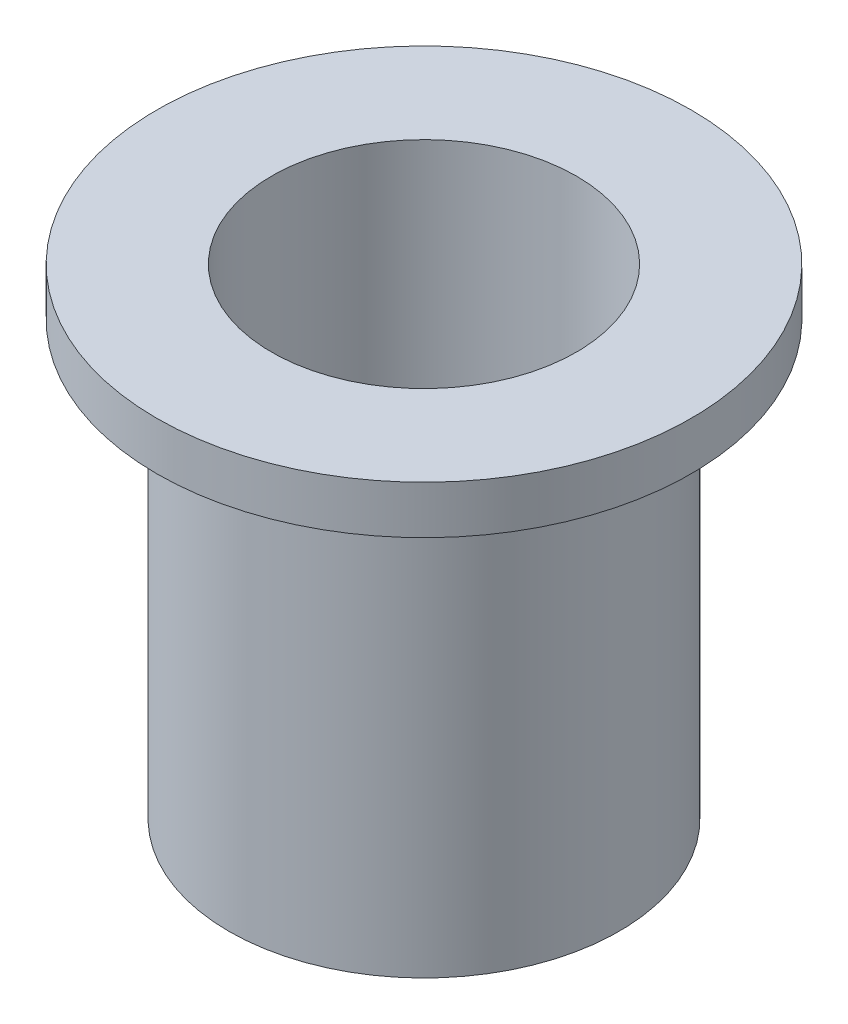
ISO-10303-21;
HEADER;
FILE_DESCRIPTION(('STEP AP214'),'2;1');
FILE_NAME('part.step','',(''),(''),'','','');
FILE_SCHEMA(('AUTOMOTIVE_DESIGN { 1 0 10303 214 1 1 1 1 }'));
ENDSEC;
DATA;
#1=APPLICATION_CONTEXT('core data for automotive mechanical design processes');
#2=APPLICATION_PROTOCOL_DEFINITION('international standard','automotive_design',2000,#1);
#3=PRODUCT_CONTEXT('',#1,'mechanical');
#4=PRODUCT('Part','Part','',(#3));
#5=PRODUCT_RELATED_PRODUCT_CATEGORY('part','',(#4));
#6=PRODUCT_DEFINITION_FORMATION('','',#4);
#7=PRODUCT_DEFINITION_CONTEXT('part definition',#1,'design');
#8=PRODUCT_DEFINITION('design','',#6,#7);
#9=PRODUCT_DEFINITION_SHAPE('','',#8);
#10=(LENGTH_UNIT() NAMED_UNIT(*) SI_UNIT(.MILLI.,.METRE.));
#11=(NAMED_UNIT(*) PLANE_ANGLE_UNIT() SI_UNIT($,.RADIAN.));
#12=(NAMED_UNIT(*) SI_UNIT($,.STERADIAN.) SOLID_ANGLE_UNIT());
#13=UNCERTAINTY_MEASURE_WITH_UNIT(LENGTH_MEASURE(1.E-05),#10,'distance_accuracy_value','');
#14=(GEOMETRIC_REPRESENTATION_CONTEXT(3) GLOBAL_UNCERTAINTY_ASSIGNED_CONTEXT((#13)) GLOBAL_UNIT_ASSIGNED_CONTEXT((#10,
#11,#12)) REPRESENTATION_CONTEXT('',''));
#15=CARTESIAN_POINT('',(0.,0.,0.));
#16=DIRECTION('',(0.,0.,1.));
#17=DIRECTION('',(1.,0.,0.));
#18=AXIS2_PLACEMENT_3D('',#15,#16,#17);
#19=CARTESIAN_POINT('',(0.,0.999999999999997,-5.5625));
#20=DIRECTION('',(0.,1.,0.));
#21=DIRECTION('',(0.,0.,1.));
#22=AXIS2_PLACEMENT_3D('',#19,#20,#21);
#23=PLANE('',#22);
#24=CARTESIAN_POINT('',(0.,0.999999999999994,0.));
#25=DIRECTION('',(0.,-1.,0.));
#26=DIRECTION('',(0.,0.,-1.));
#27=AXIS2_PLACEMENT_3D('',#24,#25,#26);
#28=CIRCLE('',#27,3.175);
#29=CARTESIAN_POINT('',(0.,0.999999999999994,-3.175));
#30=VERTEX_POINT('',#29);
#31=EDGE_CURVE('E10',#30,#30,#28,.T.);
#32=ORIENTED_EDGE('',*,*,#31,.T.);
#33=EDGE_LOOP('',(#32));
#34=FACE_BOUND('',#33,.T.);
#35=CARTESIAN_POINT('',(0.,1.,0.));
#36=DIRECTION('',(0.,-1.,0.));
#37=DIRECTION('',(0.,0.,-1.));
#38=AXIS2_PLACEMENT_3D('',#35,#36,#37);
#39=CIRCLE('',#38,5.5625);
#40=CARTESIAN_POINT('',(0.,1.,-5.5625));
#41=VERTEX_POINT('',#40);
#42=EDGE_CURVE('E52',#41,#41,#39,.T.);
#43=ORIENTED_EDGE('',*,*,#42,.F.);
#44=EDGE_LOOP('',(#43));
#45=FACE_BOUND('',#44,.T.);
#46=ADVANCED_FACE('F30',(#34,#45),#23,.T.);
#47=CARTESIAN_POINT('',(0.,0.,0.));
#48=DIRECTION('',(0.,-1.,0.));
#49=DIRECTION('',(0.,0.,-1.));
#50=AXIS2_PLACEMENT_3D('',#47,#48,#49);
#51=CYLINDRICAL_SURFACE('',#50,3.175);
#52=CARTESIAN_POINT('',(0.,-9.00000000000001,0.));
#53=DIRECTION('',(0.,-1.,0.));
#54=DIRECTION('',(0.,0.,-1.));
#55=AXIS2_PLACEMENT_3D('',#52,#53,#54);
#56=CIRCLE('',#55,3.175);
#57=CARTESIAN_POINT('',(0.,-9.00000000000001,-3.175));
#58=VERTEX_POINT('',#57);
#59=EDGE_CURVE('E36',#58,#58,#56,.T.);
#60=ORIENTED_EDGE('',*,*,#59,.T.);
#61=EDGE_LOOP('',(#60));
#62=FACE_BOUND('',#61,.T.);
#63=ORIENTED_EDGE('',*,*,#31,.F.);
#64=EDGE_LOOP('',(#63));
#65=FACE_BOUND('',#64,.T.);
#66=ADVANCED_FACE('F60',(#62,#65),#51,.F.);
#67=CARTESIAN_POINT('',(0.,-9.,-3.175));
#68=DIRECTION('',(0.,-1.,0.));
#69=DIRECTION('',(0.,0.,-1.));
#70=AXIS2_PLACEMENT_3D('',#67,#68,#69);
#71=PLANE('',#70);
#72=CARTESIAN_POINT('',(0.,-9.,0.));
#73=DIRECTION('',(0.,-1.,0.));
#74=DIRECTION('',(0.,0.,-1.));
#75=AXIS2_PLACEMENT_3D('',#72,#73,#74);
#76=CIRCLE('',#75,4.0625);
#77=CARTESIAN_POINT('',(0.,-9.,-4.0625));
#78=VERTEX_POINT('',#77);
#79=EDGE_CURVE('E40',#78,#78,#76,.T.);
#80=ORIENTED_EDGE('',*,*,#79,.T.);
#81=EDGE_LOOP('',(#80));
#82=FACE_BOUND('',#81,.T.);
#83=ORIENTED_EDGE('',*,*,#59,.F.);
#84=EDGE_LOOP('',(#83));
#85=FACE_BOUND('',#84,.T.);
#86=ADVANCED_FACE('F64',(#82,#85),#71,.T.);
#87=CARTESIAN_POINT('',(0.,0.,0.));
#88=DIRECTION('',(0.,-1.,0.));
#89=DIRECTION('',(0.,0.,-1.));
#90=AXIS2_PLACEMENT_3D('',#87,#88,#89);
#91=CYLINDRICAL_SURFACE('',#90,4.0625);
#92=CARTESIAN_POINT('',(0.,0.,0.));
#93=DIRECTION('',(0.,-1.,0.));
#94=DIRECTION('',(0.,0.,-1.));
#95=AXIS2_PLACEMENT_3D('',#92,#93,#94);
#96=CIRCLE('',#95,4.0625);
#97=CARTESIAN_POINT('',(0.,0.,-4.0625));
#98=VERTEX_POINT('',#97);
#99=EDGE_CURVE('E44',#98,#98,#96,.T.);
#100=ORIENTED_EDGE('',*,*,#99,.T.);
#101=EDGE_LOOP('',(#100));
#102=FACE_BOUND('',#101,.T.);
#103=ORIENTED_EDGE('',*,*,#79,.F.);
#104=EDGE_LOOP('',(#103));
#105=FACE_BOUND('',#104,.T.);
#106=ADVANCED_FACE('F68',(#102,#105),#91,.T.);
#107=CARTESIAN_POINT('',(0.,0.,-4.0625));
#108=DIRECTION('',(0.,-1.,0.));
#109=DIRECTION('',(0.,0.,-1.));
#110=AXIS2_PLACEMENT_3D('',#107,#108,#109);
#111=PLANE('',#110);
#112=CARTESIAN_POINT('',(0.,0.,0.));
#113=DIRECTION('',(0.,-1.,0.));
#114=DIRECTION('',(0.,0.,-1.));
#115=AXIS2_PLACEMENT_3D('',#112,#113,#114);
#116=CIRCLE('',#115,5.5625);
#117=CARTESIAN_POINT('',(0.,0.,-5.5625));
#118=VERTEX_POINT('',#117);
#119=EDGE_CURVE('E49',#118,#118,#116,.T.);
#120=ORIENTED_EDGE('',*,*,#119,.T.);
#121=EDGE_LOOP('',(#120));
#122=FACE_BOUND('',#121,.T.);
#123=ORIENTED_EDGE('',*,*,#99,.F.);
#124=EDGE_LOOP('',(#123));
#125=FACE_BOUND('',#124,.T.);
#126=ADVANCED_FACE('F75',(#122,#125),#111,.T.);
#127=CARTESIAN_POINT('',(0.,0.,0.));
#128=DIRECTION('',(0.,-1.,0.));
#129=DIRECTION('',(0.,0.,-1.));
#130=AXIS2_PLACEMENT_3D('',#127,#128,#129);
#131=CYLINDRICAL_SURFACE('',#130,5.5625);
#132=ORIENTED_EDGE('',*,*,#42,.T.);
#133=EDGE_LOOP('',(#132));
#134=FACE_BOUND('',#133,.T.);
#135=ORIENTED_EDGE('',*,*,#119,.F.);
#136=EDGE_LOOP('',(#135));
#137=FACE_BOUND('',#136,.T.);
#138=ADVANCED_FACE('F56',(#134,#137),#131,.T.);
#139=CLOSED_SHELL('',(#46,#66,#86,#106,#126,#138));
#140=MANIFOLD_SOLID_BREP('B2',#139);
#141=ADVANCED_BREP_SHAPE_REPRESENTATION('',(#18,#140),#14);
#142=SHAPE_DEFINITION_REPRESENTATION(#9,#141);
ENDSEC;
END-ISO-10303-21;
